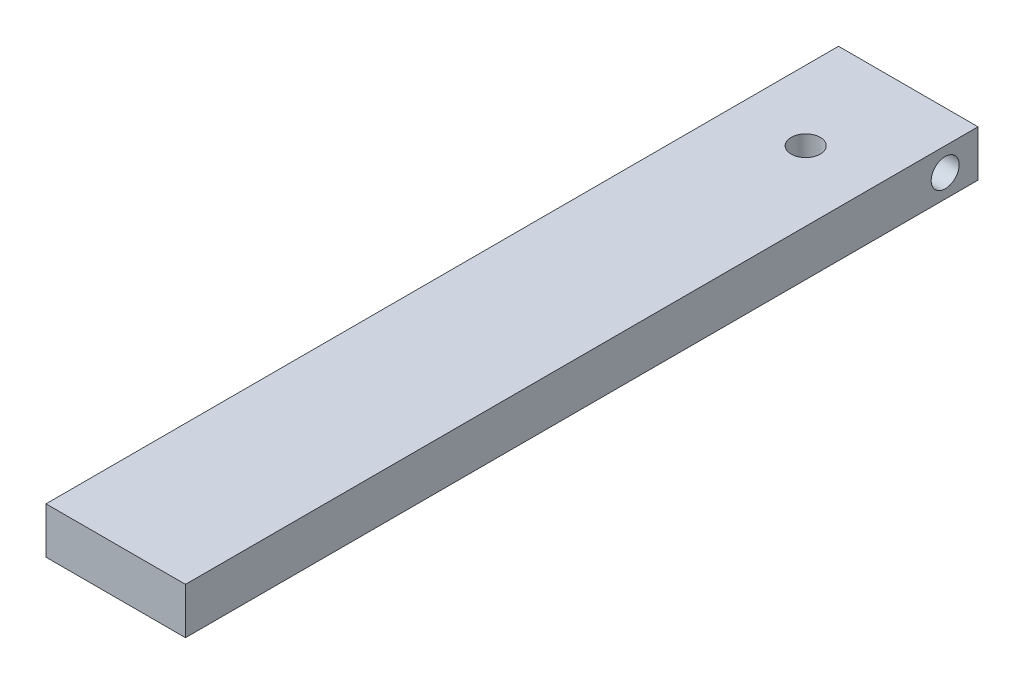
ISO-10303-21;
HEADER;
FILE_DESCRIPTION(('STEP AP214'),'2;1');
FILE_NAME('part.step','',(''),(''),'','','');
FILE_SCHEMA(('AUTOMOTIVE_DESIGN { 1 0 10303 214 1 1 1 1 }'));
ENDSEC;
DATA;
#1=APPLICATION_CONTEXT('core data for automotive mechanical design processes');
#2=APPLICATION_PROTOCOL_DEFINITION('international standard','automotive_design',2000,#1);
#3=PRODUCT_CONTEXT('',#1,'mechanical');
#4=PRODUCT('Part','Part','',(#3));
#5=PRODUCT_RELATED_PRODUCT_CATEGORY('part','',(#4));
#6=PRODUCT_DEFINITION_FORMATION('','',#4);
#7=PRODUCT_DEFINITION_CONTEXT('part definition',#1,'design');
#8=PRODUCT_DEFINITION('design','',#6,#7);
#9=PRODUCT_DEFINITION_SHAPE('','',#8);
#10=(LENGTH_UNIT() NAMED_UNIT(*) SI_UNIT(.MILLI.,.METRE.));
#11=(NAMED_UNIT(*) PLANE_ANGLE_UNIT() SI_UNIT($,.RADIAN.));
#12=(NAMED_UNIT(*) SI_UNIT($,.STERADIAN.) SOLID_ANGLE_UNIT());
#13=UNCERTAINTY_MEASURE_WITH_UNIT(LENGTH_MEASURE(1.E-05),#10,'distance_accuracy_value','');
#14=(GEOMETRIC_REPRESENTATION_CONTEXT(3) GLOBAL_UNCERTAINTY_ASSIGNED_CONTEXT((#13)) GLOBAL_UNIT_ASSIGNED_CONTEXT((#10,
#11,#12)) REPRESENTATION_CONTEXT('',''));
#15=CARTESIAN_POINT('',(0.,0.,0.));
#16=DIRECTION('',(0.,0.,1.));
#17=DIRECTION('',(1.,0.,0.));
#18=AXIS2_PLACEMENT_3D('',#15,#16,#17);
#19=CARTESIAN_POINT('',(-9.4996,-3.175,4.4704));
#20=DIRECTION('',(1.,0.,0.));
#21=DIRECTION('',(0.,1.,0.));
#22=AXIS2_PLACEMENT_3D('',#19,#20,#21);
#23=CYLINDRICAL_SURFACE('',#22,1.905);
#24=CARTESIAN_POINT('',(-1.41814139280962,-1.27,4.4704));
#25=CARTESIAN_POINT('',(-1.41816349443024,-1.27000971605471,4.54166420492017));
#26=CARTESIAN_POINT('',(-1.4236261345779,-1.27404570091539,4.61303215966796));
#27=CARTESIAN_POINT('',(-1.44443364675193,-1.28981734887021,4.75352279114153));
#28=CARTESIAN_POINT('',(-1.4598118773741,-1.30157900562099,4.82263705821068));
#29=CARTESIAN_POINT('',(-1.5046559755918,-1.33727631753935,4.9807710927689));
#30=CARTESIAN_POINT('',(-1.53717195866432,-1.36403596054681,5.0682630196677));
#31=CARTESIAN_POINT('',(-1.60976768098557,-1.42824412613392,5.23588918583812));
#32=CARTESIAN_POINT('',(-1.64986897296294,-1.4657232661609,5.31600146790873));
#33=CARTESIAN_POINT('',(-1.74859369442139,-1.565916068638,5.49712730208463));
#34=CARTESIAN_POINT('',(-1.8086219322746,-1.63284450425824,5.59505054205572));
#35=CARTESIAN_POINT('',(-1.9272982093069,-1.78398303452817,5.77733317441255));
#36=CARTESIAN_POINT('',(-1.98594736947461,-1.86817851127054,5.861703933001));
#37=CARTESIAN_POINT('',(-2.08528665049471,-2.03516939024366,5.99980992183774));
#38=CARTESIAN_POINT('',(-2.12723135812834,-2.11492898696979,6.05630224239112));
#39=CARTESIAN_POINT('',(-2.20370723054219,-2.28479639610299,6.15749775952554));
#40=CARTESIAN_POINT('',(-2.23824992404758,-2.37488777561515,6.20221931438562));
#41=CARTESIAN_POINT('',(-2.29229255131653,-2.54856337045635,6.27147345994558));
#42=CARTESIAN_POINT('',(-2.31332438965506,-2.63082841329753,6.29810523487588));
#43=CARTESIAN_POINT('',(-2.34666854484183,-2.79989692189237,6.34013091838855));
#44=CARTESIAN_POINT('',(-2.35898564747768,-2.88669786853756,6.35553099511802));
#45=CARTESIAN_POINT('',(-2.37389523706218,-3.06275420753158,6.37415557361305));
#46=CARTESIAN_POINT('',(-2.37645362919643,-3.15201710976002,6.37733738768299));
#47=CARTESIAN_POINT('',(-2.37151616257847,-3.32982710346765,6.37118070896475));
#48=CARTESIAN_POINT('',(-2.36401989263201,-3.41837416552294,6.36184170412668));
#49=CARTESIAN_POINT('',(-2.340323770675,-3.58719636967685,6.33213691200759));
#50=CARTESIAN_POINT('',(-2.32462788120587,-3.66765820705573,6.312409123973));
#51=CARTESIAN_POINT('',(-2.28598818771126,-3.82375298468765,6.26339850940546));
#52=CARTESIAN_POINT('',(-2.26304254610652,-3.89938469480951,6.23411326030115));
#53=CARTESIAN_POINT('',(-2.20880545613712,-4.05162447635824,6.16398756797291));
#54=CARTESIAN_POINT('',(-2.17692531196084,-4.12763280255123,6.12230927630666));
#55=CARTESIAN_POINT('',(-2.10802985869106,-4.27169860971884,6.03039682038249));
#56=CARTESIAN_POINT('',(-2.0710117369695,-4.33975169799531,5.98015796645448));
#57=CARTESIAN_POINT('',(-1.98574021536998,-4.48079455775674,5.86112506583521));
#58=CARTESIAN_POINT('',(-1.936744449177,-4.55190649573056,5.79064122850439));
#59=CARTESIAN_POINT('',(-1.83733755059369,-4.68199799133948,5.63997702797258));
#60=CARTESIAN_POINT('',(-1.78692471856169,-4.74096220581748,5.5597846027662));
#61=CARTESIAN_POINT('',(-1.69322792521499,-4.84155707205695,5.39769562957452));
#62=CARTESIAN_POINT('',(-1.64971142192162,-4.88427256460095,5.31660787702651));
#63=CARTESIAN_POINT('',(-1.56923438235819,-4.95843240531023,5.14639845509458));
#64=CARTESIAN_POINT('',(-1.53225961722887,-4.98990137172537,5.05729487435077));
#65=CARTESIAN_POINT('',(-1.48051739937,-5.03214288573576,4.89990973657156));
#66=CARTESIAN_POINT('',(-1.46241757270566,-5.04630443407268,4.83366192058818));
#67=CARTESIAN_POINT('',(-1.43482734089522,-5.06754624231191,4.6983471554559));
#68=CARTESIAN_POINT('',(-1.42531744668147,-5.0746425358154,4.62928696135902));
#69=CARTESIAN_POINT('',(-1.41655677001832,-5.08118865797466,4.4896955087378));
#70=CARTESIAN_POINT('',(-1.41736812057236,-5.08059217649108,4.41915789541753));
#71=CARTESIAN_POINT('',(-1.42923932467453,-5.07170003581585,4.27941498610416));
#72=CARTESIAN_POINT('',(-1.44031341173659,-5.06339368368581,4.21021167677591));
#73=CARTESIAN_POINT('',(-1.47454283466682,-5.03683697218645,4.05815576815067));
#74=CARTESIAN_POINT('',(-1.50001767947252,-5.01662742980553,3.9761884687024));
#75=CARTESIAN_POINT('',(-1.55917200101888,-4.96682251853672,3.8182513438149));
#76=CARTESIAN_POINT('',(-1.5928760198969,-4.93719899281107,3.74230037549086));
#77=CARTESIAN_POINT('',(-1.68133826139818,-4.85382273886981,3.56237934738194));
#78=CARTESIAN_POINT('',(-1.73858332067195,-4.7952605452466,3.46186784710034));
#79=CARTESIAN_POINT('',(-1.85431129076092,-4.66145934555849,3.27339559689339));
#80=CARTESIAN_POINT('',(-1.91279562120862,-4.58620016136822,3.18545024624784));
#81=CARTESIAN_POINT('',(-2.02623062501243,-4.41798050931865,3.0219584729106));
#82=CARTESIAN_POINT('',(-2.08111355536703,-4.32476686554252,2.94662230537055));
#83=CARTESIAN_POINT('',(-2.18075492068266,-4.12215413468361,2.8131365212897));
#84=CARTESIAN_POINT('',(-2.22554594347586,-4.01280908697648,2.75493139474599));
#85=CARTESIAN_POINT('',(-2.28772883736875,-3.8178893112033,2.67513496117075));
#86=CARTESIAN_POINT('',(-2.30929946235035,-3.73598684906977,2.64778874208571));
#87=CARTESIAN_POINT('',(-2.34381127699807,-3.56751224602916,2.60425272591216));
#88=CARTESIAN_POINT('',(-2.35675907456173,-3.48094373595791,2.58805438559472));
#89=CARTESIAN_POINT('',(-2.37297929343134,-3.305146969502,2.56778524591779));
#90=CARTESIAN_POINT('',(-2.37621500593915,-3.21590990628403,2.5637604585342));
#91=CARTESIAN_POINT('',(-2.37261201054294,-3.03795473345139,2.56825259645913));
#92=CARTESIAN_POINT('',(-2.36577279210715,-2.94923665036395,2.57677015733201));
#93=CARTESIAN_POINT('',(-2.34328909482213,-2.77999054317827,2.6049389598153));
#94=CARTESIAN_POINT('',(-2.32815950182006,-2.69928215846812,2.62393957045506));
#95=CARTESIAN_POINT('',(-2.2905676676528,-2.54258455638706,2.67157023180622));
#96=CARTESIAN_POINT('',(-2.26810352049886,-2.46659657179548,2.70020278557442));
#97=CARTESIAN_POINT('',(-2.21490877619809,-2.31392896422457,2.76886809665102));
#98=CARTESIAN_POINT('',(-2.18361439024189,-2.23780805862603,2.80969756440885));
#99=CARTESIAN_POINT('',(-2.11581359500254,-2.09340045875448,2.89991365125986));
#100=CARTESIAN_POINT('',(-2.07930456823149,-2.02511773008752,2.94930457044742));
#101=CARTESIAN_POINT('',(-1.99512895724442,-1.88360771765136,3.06633388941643));
#102=CARTESIAN_POINT('',(-1.94670544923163,-1.81221252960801,3.1356393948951));
#103=CARTESIAN_POINT('',(-1.84821958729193,-1.68136593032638,3.28386014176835));
#104=CARTESIAN_POINT('',(-1.79815516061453,-1.62193035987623,3.36278790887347));
#105=CARTESIAN_POINT('',(-1.70349950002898,-1.51885826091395,3.52445368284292));
#106=CARTESIAN_POINT('',(-1.65876389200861,-1.47444700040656,3.60661245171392));
#107=CARTESIAN_POINT('',(-1.5757602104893,-1.39726981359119,3.77930935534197));
#108=CARTESIAN_POINT('',(-1.53748002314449,-1.36448194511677,3.86983129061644));
#109=CARTESIAN_POINT('',(-1.48361664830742,-1.32031399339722,4.03016181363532));
#110=CARTESIAN_POINT('',(-1.46467207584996,-1.30545423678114,4.09785752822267));
#111=CARTESIAN_POINT('',(-1.43577729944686,-1.28316392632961,4.23622423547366));
#112=CARTESIAN_POINT('',(-1.42579267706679,-1.27570493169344,4.30688274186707));
#113=CARTESIAN_POINT('',(-1.41914133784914,-1.27074575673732,4.40873383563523));
#114=CARTESIAN_POINT('',(-1.41813182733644,-1.2699957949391,4.43955720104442));
#115=CARTESIAN_POINT('',(-1.41814139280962,-1.27,4.4704));
#116=B_SPLINE_CURVE_WITH_KNOTS('',3,(#24,#25,#26,#27,#28,#29,#30,#31,#32,#33,#34,#35,#36,#37,
#38,#39,#40,#41,#42,#43,#44,#45,#46,#47,#48,#49,#50,#51,#52,#53,#54,#55,#56,#57,#58,#59,#60,#61,
#62,#63,#64,#65,#66,#67,#68,#69,#70,#71,#72,#73,#74,#75,#76,#77,#78,#79,#80,#81,#82,#83,#84,#85,
#86,#87,#88,#89,#90,#91,#92,#93,#94,#95,#96,#97,#98,#99,#100,#101,#102,#103,#104,#105,#106,#107,
#108,#109,#110,#111,#112,#113,#114,#115),.UNSPECIFIED.,.T.,.F.,(4,2,2,2,2,2,2,2,2,2,2,2,2,2,2,2,
2,2,2,2,2,2,2,2,2,2,2,2,2,2,2,2,2,2,2,2,2,2,2,2,2,2,2,2,2,4),(0.,0.213682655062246,
0.428087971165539,0.71774748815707,1.00824274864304,1.40512586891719,1.80167437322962,
2.1195547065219,2.43693627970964,2.70277665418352,2.96847092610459,3.23509263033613,
3.50172523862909,3.75362061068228,4.00557988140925,4.2816611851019,4.55789422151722,
4.89111357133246,5.22475124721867,5.52824048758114,5.83106127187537,6.04066481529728,
6.2497916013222,6.46017790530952,6.67085643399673,6.93392601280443,7.19778994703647,
7.58475161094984,7.97218348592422,8.36554215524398,8.75761181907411,9.0235277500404,
9.28923966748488,9.55595464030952,9.82268312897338,10.0744652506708,10.3263128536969,
10.6009324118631,10.8756903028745,11.2064883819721,11.5377217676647,11.8474696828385,
12.1566297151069,12.3714096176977,12.5853608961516,12.6778417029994),.UNSPECIFIED.);
#117=CARTESIAN_POINT('',(-1.41814139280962,-1.27,4.4704));
#118=VERTEX_POINT('',#117);
#119=EDGE_CURVE('E39',#118,#118,#116,.T.);
#120=ORIENTED_EDGE('',*,*,#119,.T.);
#121=EDGE_LOOP('',(#120));
#122=FACE_BOUND('',#121,.T.);
#123=CARTESIAN_POINT('',(-9.4996,-3.175,4.4704));
#124=DIRECTION('',(1.,0.,0.));
#125=DIRECTION('',(0.,1.,0.));
#126=AXIS2_PLACEMENT_3D('',#123,#124,#125);
#127=CIRCLE('',#126,1.905);
#128=CARTESIAN_POINT('',(-9.4996,-1.27,4.4704));
#129=VERTEX_POINT('',#128);
#130=EDGE_CURVE('E159',#129,#129,#127,.T.);
#131=ORIENTED_EDGE('',*,*,#130,.F.);
#132=EDGE_LOOP('',(#131));
#133=FACE_BOUND('',#132,.T.);
#134=ADVANCED_FACE('F35',(#122,#133),#23,.F.);
#135=CARTESIAN_POINT('',(-9.4996,0.,107.95));
#136=DIRECTION('',(1.,0.,0.));
#137=DIRECTION('',(0.,1.,0.));
#138=AXIS2_PLACEMENT_3D('',#135,#136,#137);
#139=PLANE('',#138);
#140=ORIENTED_EDGE('',*,*,#130,.T.);
#141=EDGE_LOOP('',(#140));
#142=FACE_BOUND('',#141,.T.);
#143=DIRECTION('',(0.,0.,-1.));
#144=VECTOR('',#143,1.);
#145=CARTESIAN_POINT('',(-9.4996,-6.2992,107.95));
#146=LINE('',#145,#144);
#147=CARTESIAN_POINT('',(-9.4996,-6.2992,107.95));
#148=VERTEX_POINT('',#147);
#149=CARTESIAN_POINT('',(-9.4996,-6.2992,0.));
#150=VERTEX_POINT('',#149);
#151=EDGE_CURVE('E11',#148,#150,#146,.T.);
#152=ORIENTED_EDGE('',*,*,#151,.F.);
#153=DIRECTION('',(0.,-1.,0.));
#154=VECTOR('',#153,1.);
#155=CARTESIAN_POINT('',(-9.4996,0.,107.95));
#156=LINE('',#155,#154);
#157=CARTESIAN_POINT('',(-9.4996,0.,107.95));
#158=VERTEX_POINT('',#157);
#159=EDGE_CURVE('E107',#158,#148,#156,.T.);
#160=ORIENTED_EDGE('',*,*,#159,.F.);
#161=DIRECTION('',(0.,0.,-1.));
#162=VECTOR('',#161,1.);
#163=CARTESIAN_POINT('',(-9.4996,0.,107.95));
#164=LINE('',#163,#162);
#165=CARTESIAN_POINT('',(-9.4996,0.,0.));
#166=VERTEX_POINT('',#165);
#167=EDGE_CURVE('E57',#158,#166,#164,.T.);
#168=ORIENTED_EDGE('',*,*,#167,.T.);
#169=DIRECTION('',(0.,-1.,0.));
#170=VECTOR('',#169,1.);
#171=CARTESIAN_POINT('',(-9.4996,0.,0.));
#172=LINE('',#171,#170);
#173=EDGE_CURVE('E93',#166,#150,#172,.T.);
#174=ORIENTED_EDGE('',*,*,#173,.T.);
#175=EDGE_LOOP('',(#152,#160,#168,#174));
#176=FACE_BOUND('',#175,.T.);
#177=ADVANCED_FACE('F94',(#142,#176),#139,.F.);
#178=CARTESIAN_POINT('',(9.4996,-6.2992,107.95));
#179=DIRECTION('',(0.,-1.,0.));
#180=DIRECTION('',(1.,0.,0.));
#181=AXIS2_PLACEMENT_3D('',#178,#179,#180);
#182=PLANE('',#181);
#183=CARTESIAN_POINT('',(0.,-6.2992,13.97));
#184=DIRECTION('',(0.,1.,0.));
#185=DIRECTION('',(-1.,0.,0.));
#186=AXIS2_PLACEMENT_3D('',#183,#184,#185);
#187=CIRCLE('',#186,1.9812);
#188=CARTESIAN_POINT('',(-1.9812,-6.2992,13.97));
#189=VERTEX_POINT('',#188);
#190=EDGE_CURVE('E97',#189,#189,#187,.T.);
#191=ORIENTED_EDGE('',*,*,#190,.T.);
#192=EDGE_LOOP('',(#191));
#193=FACE_BOUND('',#192,.T.);
#194=DIRECTION('',(0.,0.,-1.));
#195=VECTOR('',#194,1.);
#196=CARTESIAN_POINT('',(9.4996,-6.2992,107.95));
#197=LINE('',#196,#195);
#198=CARTESIAN_POINT('',(9.4996,-6.2992,107.95));
#199=VERTEX_POINT('',#198);
#200=CARTESIAN_POINT('',(9.4996,-6.2992,0.));
#201=VERTEX_POINT('',#200);
#202=EDGE_CURVE('E49',#199,#201,#197,.T.);
#203=ORIENTED_EDGE('',*,*,#202,.F.);
#204=DIRECTION('',(-1.,0.,0.));
#205=VECTOR('',#204,1.);
#206=CARTESIAN_POINT('',(9.4996,-6.2992,107.95));
#207=LINE('',#206,#205);
#208=EDGE_CURVE('E89',#199,#148,#207,.T.);
#209=ORIENTED_EDGE('',*,*,#208,.T.);
#210=ORIENTED_EDGE('',*,*,#151,.T.);
#211=DIRECTION('',(-1.,0.,0.));
#212=VECTOR('',#211,1.);
#213=CARTESIAN_POINT('',(9.4996,-6.2992,0.));
#214=LINE('',#213,#212);
#215=EDGE_CURVE('E86',#201,#150,#214,.T.);
#216=ORIENTED_EDGE('',*,*,#215,.F.);
#217=EDGE_LOOP('',(#203,#209,#210,#216));
#218=FACE_BOUND('',#217,.T.);
#219=ADVANCED_FACE('F37',(#193,#218),#182,.T.);
#220=CARTESIAN_POINT('',(9.4996,-6.2992,107.95));
#221=DIRECTION('',(-1.,0.,0.));
#222=DIRECTION('',(0.,-1.,0.));
#223=AXIS2_PLACEMENT_3D('',#220,#221,#222);
#224=PLANE('',#223);
#225=CARTESIAN_POINT('',(9.4996,-3.17500000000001,4.4704));
#226=DIRECTION('',(1.,0.,0.));
#227=DIRECTION('',(0.,1.,0.));
#228=AXIS2_PLACEMENT_3D('',#225,#226,#227);
#229=CIRCLE('',#228,1.905);
#230=CARTESIAN_POINT('',(9.4996,-1.27000000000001,4.4704));
#231=VERTEX_POINT('',#230);
#232=EDGE_CURVE('E157',#231,#231,#229,.T.);
#233=ORIENTED_EDGE('',*,*,#232,.F.);
#234=EDGE_LOOP('',(#233));
#235=FACE_BOUND('',#234,.T.);
#236=DIRECTION('',(0.,0.,-1.));
#237=VECTOR('',#236,1.);
#238=CARTESIAN_POINT('',(9.4996,0.,107.95));
#239=LINE('',#238,#237);
#240=CARTESIAN_POINT('',(9.4996,0.,107.95));
#241=VERTEX_POINT('',#240);
#242=CARTESIAN_POINT('',(9.4996,0.,0.));
#243=VERTEX_POINT('',#242);
#244=EDGE_CURVE('E65',#241,#243,#239,.T.);
#245=ORIENTED_EDGE('',*,*,#244,.F.);
#246=DIRECTION('',(0.,1.,0.));
#247=VECTOR('',#246,1.);
#248=CARTESIAN_POINT('',(9.4996,-6.2992,107.95));
#249=LINE('',#248,#247);
#250=EDGE_CURVE('E110',#199,#241,#249,.T.);
#251=ORIENTED_EDGE('',*,*,#250,.F.);
#252=ORIENTED_EDGE('',*,*,#202,.T.);
#253=DIRECTION('',(0.,1.,0.));
#254=VECTOR('',#253,1.);
#255=CARTESIAN_POINT('',(9.4996,-6.2992,0.));
#256=LINE('',#255,#254);
#257=EDGE_CURVE('E100',#201,#243,#256,.T.);
#258=ORIENTED_EDGE('',*,*,#257,.T.);
#259=EDGE_LOOP('',(#245,#251,#252,#258));
#260=FACE_BOUND('',#259,.T.);
#261=ADVANCED_FACE('F177',(#235,#260),#224,.F.);
#262=CARTESIAN_POINT('',(-9.4996,0.,107.95));
#263=DIRECTION('',(0.,1.,0.));
#264=DIRECTION('',(-1.,0.,0.));
#265=AXIS2_PLACEMENT_3D('',#262,#263,#264);
#266=PLANE('',#265);
#267=CARTESIAN_POINT('',(0.,0.,13.97));
#268=DIRECTION('',(0.,1.,0.));
#269=DIRECTION('',(-1.,0.,0.));
#270=AXIS2_PLACEMENT_3D('',#267,#268,#269);
#271=CIRCLE('',#270,1.9812);
#272=CARTESIAN_POINT('',(-1.9812,0.,13.97));
#273=VERTEX_POINT('',#272);
#274=EDGE_CURVE('E162',#273,#273,#271,.T.);
#275=ORIENTED_EDGE('',*,*,#274,.F.);
#276=EDGE_LOOP('',(#275));
#277=FACE_BOUND('',#276,.T.);
#278=DIRECTION('',(1.,0.,0.));
#279=VECTOR('',#278,1.);
#280=CARTESIAN_POINT('',(-9.4996,0.,107.95));
#281=LINE('',#280,#279);
#282=EDGE_CURVE('E112',#158,#241,#281,.T.);
#283=ORIENTED_EDGE('',*,*,#282,.T.);
#284=ORIENTED_EDGE('',*,*,#244,.T.);
#285=DIRECTION('',(1.,0.,0.));
#286=VECTOR('',#285,1.);
#287=CARTESIAN_POINT('',(-9.4996,0.,0.));
#288=LINE('',#287,#286);
#289=EDGE_CURVE('E102',#166,#243,#288,.T.);
#290=ORIENTED_EDGE('',*,*,#289,.F.);
#291=ORIENTED_EDGE('',*,*,#167,.F.);
#292=EDGE_LOOP('',(#283,#284,#290,#291));
#293=FACE_BOUND('',#292,.T.);
#294=ADVANCED_FACE('F174',(#277,#293),#266,.T.);
#295=CARTESIAN_POINT('',(-9.4996,0.,107.95));
#296=DIRECTION('',(0.,0.,1.));
#297=DIRECTION('',(1.,0.,0.));
#298=AXIS2_PLACEMENT_3D('',#295,#296,#297);
#299=PLANE('',#298);
#300=ORIENTED_EDGE('',*,*,#159,.T.);
#301=ORIENTED_EDGE('',*,*,#208,.F.);
#302=ORIENTED_EDGE('',*,*,#250,.T.);
#303=ORIENTED_EDGE('',*,*,#282,.F.);
#304=EDGE_LOOP('',(#300,#301,#302,#303));
#305=FACE_BOUND('',#304,.T.);
#306=ADVANCED_FACE('F176',(#305),#299,.T.);
#307=CARTESIAN_POINT('',(-9.4996,0.,0.));
#308=DIRECTION('',(0.,0.,1.));
#309=DIRECTION('',(1.,0.,0.));
#310=AXIS2_PLACEMENT_3D('',#307,#308,#309);
#311=PLANE('',#310);
#312=CARTESIAN_POINT('',(0.,-3.175,0.));
#313=DIRECTION('',(0.,0.,-1.));
#314=DIRECTION('',(-1.,0.,0.));
#315=AXIS2_PLACEMENT_3D('',#312,#313,#314);
#316=CIRCLE('',#315,2.3749);
#317=CARTESIAN_POINT('',(-2.3749,-3.175,0.));
#318=VERTEX_POINT('',#317);
#319=EDGE_CURVE('E196',#318,#318,#316,.T.);
#320=ORIENTED_EDGE('',*,*,#319,.F.);
#321=EDGE_LOOP('',(#320));
#322=FACE_BOUND('',#321,.T.);
#323=ORIENTED_EDGE('',*,*,#173,.F.);
#324=ORIENTED_EDGE('',*,*,#289,.T.);
#325=ORIENTED_EDGE('',*,*,#257,.F.);
#326=ORIENTED_EDGE('',*,*,#215,.T.);
#327=EDGE_LOOP('',(#323,#324,#325,#326));
#328=FACE_BOUND('',#327,.T.);
#329=ADVANCED_FACE('F99',(#322,#328),#311,.F.);
#330=CARTESIAN_POINT('',(0.,-6.2992,13.97));
#331=DIRECTION('',(0.,1.,0.));
#332=DIRECTION('',(-1.,0.,0.));
#333=AXIS2_PLACEMENT_3D('',#330,#331,#332);
#334=CYLINDRICAL_SURFACE('',#333,1.9812);
#335=ORIENTED_EDGE('',*,*,#190,.F.);
#336=EDGE_LOOP('',(#335));
#337=FACE_BOUND('',#336,.T.);
#338=ORIENTED_EDGE('',*,*,#274,.T.);
#339=EDGE_LOOP('',(#338));
#340=FACE_BOUND('',#339,.T.);
#341=ADVANCED_FACE('F147',(#337,#340),#334,.F.);
#342=CARTESIAN_POINT('',(1.41814139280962,-1.27,4.4704));
#343=CARTESIAN_POINT('',(1.41816349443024,-1.27000971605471,4.39913579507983));
#344=CARTESIAN_POINT('',(1.4236261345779,-1.27404570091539,4.32776784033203));
#345=CARTESIAN_POINT('',(1.44443364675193,-1.28981734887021,4.18727720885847));
#346=CARTESIAN_POINT('',(1.4598118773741,-1.30157900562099,4.11816294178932));
#347=CARTESIAN_POINT('',(1.5046559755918,-1.33727631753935,3.9600289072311));
#348=CARTESIAN_POINT('',(1.53717195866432,-1.36403596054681,3.8725369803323));
#349=CARTESIAN_POINT('',(1.60976768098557,-1.42824412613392,3.70491081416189));
#350=CARTESIAN_POINT('',(1.64986897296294,-1.4657232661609,3.62479853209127));
#351=CARTESIAN_POINT('',(1.74859369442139,-1.565916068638,3.44367269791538));
#352=CARTESIAN_POINT('',(1.8086219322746,-1.63284450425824,3.34574945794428));
#353=CARTESIAN_POINT('',(1.92729820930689,-1.78398303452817,3.16346682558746));
#354=CARTESIAN_POINT('',(1.98594736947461,-1.86817851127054,3.079096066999));
#355=CARTESIAN_POINT('',(2.08528665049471,-2.03516939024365,2.94099007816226));
#356=CARTESIAN_POINT('',(2.12723135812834,-2.11492898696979,2.88449775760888));
#357=CARTESIAN_POINT('',(2.20370723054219,-2.28479639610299,2.78330224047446));
#358=CARTESIAN_POINT('',(2.23824992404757,-2.37488777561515,2.73858068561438));
#359=CARTESIAN_POINT('',(2.29229255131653,-2.54856337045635,2.66932654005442));
#360=CARTESIAN_POINT('',(2.31332438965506,-2.63082841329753,2.64269476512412));
#361=CARTESIAN_POINT('',(2.34666854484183,-2.79989692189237,2.60066908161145));
#362=CARTESIAN_POINT('',(2.35898564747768,-2.88669786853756,2.58526900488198));
#363=CARTESIAN_POINT('',(2.37389523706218,-3.06275420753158,2.56664442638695));
#364=CARTESIAN_POINT('',(2.37645362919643,-3.15201710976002,2.56346261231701));
#365=CARTESIAN_POINT('',(2.37151616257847,-3.32982710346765,2.56961929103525));
#366=CARTESIAN_POINT('',(2.36401989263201,-3.41837416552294,2.57895829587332));
#367=CARTESIAN_POINT('',(2.340323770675,-3.58719636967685,2.60866308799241));
#368=CARTESIAN_POINT('',(2.32462788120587,-3.66765820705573,2.628390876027));
#369=CARTESIAN_POINT('',(2.28598818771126,-3.82375298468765,2.67740149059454));
#370=CARTESIAN_POINT('',(2.26304254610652,-3.89938469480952,2.70668673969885));
#371=CARTESIAN_POINT('',(2.20880545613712,-4.05162447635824,2.77681243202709));
#372=CARTESIAN_POINT('',(2.17692531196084,-4.12763280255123,2.81849072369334));
#373=CARTESIAN_POINT('',(2.10802985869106,-4.27169860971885,2.91040317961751));
#374=CARTESIAN_POINT('',(2.07101173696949,-4.33975169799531,2.96064203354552));
#375=CARTESIAN_POINT('',(1.98574021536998,-4.48079455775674,3.07967493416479));
#376=CARTESIAN_POINT('',(1.936744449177,-4.55190649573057,3.15015877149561));
#377=CARTESIAN_POINT('',(1.83733755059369,-4.68199799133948,3.30082297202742));
#378=CARTESIAN_POINT('',(1.78692471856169,-4.74096220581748,3.3810153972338));
#379=CARTESIAN_POINT('',(1.69322792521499,-4.84155707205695,3.54310437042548));
#380=CARTESIAN_POINT('',(1.64971142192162,-4.88427256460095,3.62419212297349));
#381=CARTESIAN_POINT('',(1.56923438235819,-4.95843240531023,3.79440154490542));
#382=CARTESIAN_POINT('',(1.53225961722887,-4.98990137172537,3.88350512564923));
#383=CARTESIAN_POINT('',(1.48051739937,-5.03214288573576,4.04089026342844));
#384=CARTESIAN_POINT('',(1.46241757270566,-5.04630443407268,4.10713807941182));
#385=CARTESIAN_POINT('',(1.43482734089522,-5.06754624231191,4.24245284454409));
#386=CARTESIAN_POINT('',(1.42531744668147,-5.0746425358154,4.31151303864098));
#387=CARTESIAN_POINT('',(1.41655677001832,-5.08118865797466,4.4511044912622));
#388=CARTESIAN_POINT('',(1.41736812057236,-5.08059217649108,4.52164210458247));
#389=CARTESIAN_POINT('',(1.42923932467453,-5.07170003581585,4.66138501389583));
#390=CARTESIAN_POINT('',(1.44031341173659,-5.06339368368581,4.73058832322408));
#391=CARTESIAN_POINT('',(1.47454283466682,-5.03683697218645,4.88264423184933));
#392=CARTESIAN_POINT('',(1.50001767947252,-5.01662742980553,4.9646115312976));
#393=CARTESIAN_POINT('',(1.55917200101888,-4.96682251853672,5.12254865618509));
#394=CARTESIAN_POINT('',(1.59287601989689,-4.93719899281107,5.19849962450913));
#395=CARTESIAN_POINT('',(1.68133826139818,-4.85382273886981,5.37842065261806));
#396=CARTESIAN_POINT('',(1.73858332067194,-4.7952605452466,5.47893215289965));
#397=CARTESIAN_POINT('',(1.85431129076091,-4.66145934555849,5.6674044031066));
#398=CARTESIAN_POINT('',(1.91279562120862,-4.58620016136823,5.75534975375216));
#399=CARTESIAN_POINT('',(2.02623062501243,-4.41798050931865,5.9188415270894));
#400=CARTESIAN_POINT('',(2.08111355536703,-4.32476686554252,5.99417769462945));
#401=CARTESIAN_POINT('',(2.18075492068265,-4.12215413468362,6.12766347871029));
#402=CARTESIAN_POINT('',(2.22554594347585,-4.01280908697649,6.18586860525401));
#403=CARTESIAN_POINT('',(2.28772883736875,-3.8178893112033,6.26566503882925));
#404=CARTESIAN_POINT('',(2.30929946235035,-3.73598684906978,6.29301125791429));
#405=CARTESIAN_POINT('',(2.34381127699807,-3.56751224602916,6.33654727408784));
#406=CARTESIAN_POINT('',(2.35675907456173,-3.48094373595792,6.35274561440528));
#407=CARTESIAN_POINT('',(2.37297929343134,-3.305146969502,6.37301475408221));
#408=CARTESIAN_POINT('',(2.37621500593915,-3.21590990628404,6.3770395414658));
#409=CARTESIAN_POINT('',(2.37261201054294,-3.03795473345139,6.37254740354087));
#410=CARTESIAN_POINT('',(2.36577279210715,-2.94923665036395,6.36402984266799));
#411=CARTESIAN_POINT('',(2.34328909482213,-2.77999054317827,6.3358610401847));
#412=CARTESIAN_POINT('',(2.32815950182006,-2.69928215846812,6.31686042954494));
#413=CARTESIAN_POINT('',(2.2905676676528,-2.54258455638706,6.26922976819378));
#414=CARTESIAN_POINT('',(2.26810352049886,-2.46659657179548,6.24059721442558));
#415=CARTESIAN_POINT('',(2.21490877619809,-2.31392896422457,6.17193190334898));
#416=CARTESIAN_POINT('',(2.18361439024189,-2.23780805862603,6.13110243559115));
#417=CARTESIAN_POINT('',(2.11581359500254,-2.09340045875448,6.04088634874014));
#418=CARTESIAN_POINT('',(2.07930456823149,-2.02511773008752,5.99149542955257));
#419=CARTESIAN_POINT('',(1.99512895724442,-1.88360771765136,5.87446611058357));
#420=CARTESIAN_POINT('',(1.94670544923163,-1.81221252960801,5.8051606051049));
#421=CARTESIAN_POINT('',(1.84821958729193,-1.68136593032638,5.65693985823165));
#422=CARTESIAN_POINT('',(1.79815516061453,-1.62193035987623,5.57801209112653));
#423=CARTESIAN_POINT('',(1.70349950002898,-1.51885826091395,5.41634631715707));
#424=CARTESIAN_POINT('',(1.65876389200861,-1.47444700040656,5.33418754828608));
#425=CARTESIAN_POINT('',(1.5757602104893,-1.39726981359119,5.16149064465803));
#426=CARTESIAN_POINT('',(1.53748002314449,-1.36448194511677,5.07096870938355));
#427=CARTESIAN_POINT('',(1.48361664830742,-1.32031399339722,4.91063818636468));
#428=CARTESIAN_POINT('',(1.46467207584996,-1.30545423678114,4.84294247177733));
#429=CARTESIAN_POINT('',(1.43577729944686,-1.28316392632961,4.70457576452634));
#430=CARTESIAN_POINT('',(1.42579267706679,-1.27570493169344,4.63391725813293));
#431=CARTESIAN_POINT('',(1.41914133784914,-1.27074575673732,4.53206616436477));
#432=CARTESIAN_POINT('',(1.41813182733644,-1.2699957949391,4.50124279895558));
#433=CARTESIAN_POINT('',(1.41814139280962,-1.27,4.4704));
#434=B_SPLINE_CURVE_WITH_KNOTS('',3,(#342,#343,#344,#345,#346,#347,#348,#349,#350,#351,#352,
#353,#354,#355,#356,#357,#358,#359,#360,#361,#362,#363,#364,#365,#366,#367,#368,#369,#370,#371,
#372,#373,#374,#375,#376,#377,#378,#379,#380,#381,#382,#383,#384,#385,#386,#387,#388,#389,#390,
#391,#392,#393,#394,#395,#396,#397,#398,#399,#400,#401,#402,#403,#404,#405,#406,#407,#408,#409,
#410,#411,#412,#413,#414,#415,#416,#417,#418,#419,#420,#421,#422,#423,#424,#425,#426,#427,#428,
#429,#430,#431,#432,#433),.UNSPECIFIED.,.T.,.F.,(4,2,2,2,2,2,2,2,2,2,2,2,2,2,2,2,2,2,2,2,2,2,2,
2,2,2,2,2,2,2,2,2,2,2,2,2,2,2,2,2,2,2,2,2,2,4),(0.,0.213682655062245,0.428087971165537,
0.717747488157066,1.00824274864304,1.40512586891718,1.80167437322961,2.1195547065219,
2.43693627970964,2.70277665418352,2.96847092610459,3.23509263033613,3.50172523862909,
3.75362061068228,4.00557988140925,4.2816611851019,4.55789422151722,4.89111357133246,
5.22475124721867,5.52824048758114,5.83106127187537,6.04066481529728,6.2497916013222,
6.46017790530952,6.67085643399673,6.93392601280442,7.19778994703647,7.58475161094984,
7.97218348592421,8.36554215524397,8.75761181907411,9.0235277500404,9.28923966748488,
9.55595464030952,9.82268312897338,10.0744652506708,10.3263128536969,10.6009324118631,
10.8756903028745,11.2064883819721,11.5377217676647,11.8474696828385,12.1566297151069,
12.3714096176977,12.5853608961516,12.6778417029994),.UNSPECIFIED.);
#435=CARTESIAN_POINT('',(1.41814139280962,-1.27,4.4704));
#436=VERTEX_POINT('',#435);
#437=EDGE_CURVE('E116',#436,#436,#434,.T.);
#438=ORIENTED_EDGE('',*,*,#437,.T.);
#439=EDGE_LOOP('',(#438));
#440=FACE_BOUND('',#439,.T.);
#441=ORIENTED_EDGE('',*,*,#232,.T.);
#442=EDGE_LOOP('',(#441));
#443=FACE_BOUND('',#442,.T.);
#444=ADVANCED_FACE('F122',(#440,#443),#23,.F.);
#445=CARTESIAN_POINT('',(0.,-3.175,9.525));
#446=DIRECTION('',(0.,0.,-1.));
#447=DIRECTION('',(-1.,0.,0.));
#448=AXIS2_PLACEMENT_3D('',#445,#446,#447);
#449=CYLINDRICAL_SURFACE('',#448,2.3749);
#450=ORIENTED_EDGE('',*,*,#437,.F.);
#451=EDGE_LOOP('',(#450));
#452=FACE_BOUND('',#451,.T.);
#453=CARTESIAN_POINT('',(0.,-3.175,9.525));
#454=DIRECTION('',(0.,0.,-1.));
#455=DIRECTION('',(-1.,0.,0.));
#456=AXIS2_PLACEMENT_3D('',#453,#454,#455);
#457=CIRCLE('',#456,2.3749);
#458=CARTESIAN_POINT('',(-2.3749,-3.175,9.525));
#459=VERTEX_POINT('',#458);
#460=EDGE_CURVE('E121',#459,#459,#457,.T.);
#461=ORIENTED_EDGE('',*,*,#460,.F.);
#462=EDGE_LOOP('',(#461));
#463=FACE_BOUND('',#462,.T.);
#464=ORIENTED_EDGE('',*,*,#319,.T.);
#465=EDGE_LOOP('',(#464));
#466=FACE_BOUND('',#465,.T.);
#467=ORIENTED_EDGE('',*,*,#119,.F.);
#468=EDGE_LOOP('',(#467));
#469=FACE_BOUND('',#468,.T.);
#470=ADVANCED_FACE('F125',(#452,#463,#466,#469),#449,.F.);
#471=CARTESIAN_POINT('',(0.,-3.175,9.525));
#472=DIRECTION('',(0.,0.,-1.));
#473=DIRECTION('',(-1.,0.,0.));
#474=AXIS2_PLACEMENT_3D('',#471,#472,#473);
#475=PLANE('',#474);
#476=ORIENTED_EDGE('',*,*,#460,.T.);
#477=EDGE_LOOP('',(#476));
#478=FACE_BOUND('',#477,.T.);
#479=ADVANCED_FACE('F129',(#478),#475,.T.);
#480=CLOSED_SHELL('',(#134,#177,#219,#261,#294,#306,#329,#341,#444,#470,#479));
#481=MANIFOLD_SOLID_BREP('B2',#480);
#482=ADVANCED_BREP_SHAPE_REPRESENTATION('',(#18,#481),#14);
#483=SHAPE_DEFINITION_REPRESENTATION(#9,#482);
ENDSEC;
END-ISO-10303-21;
